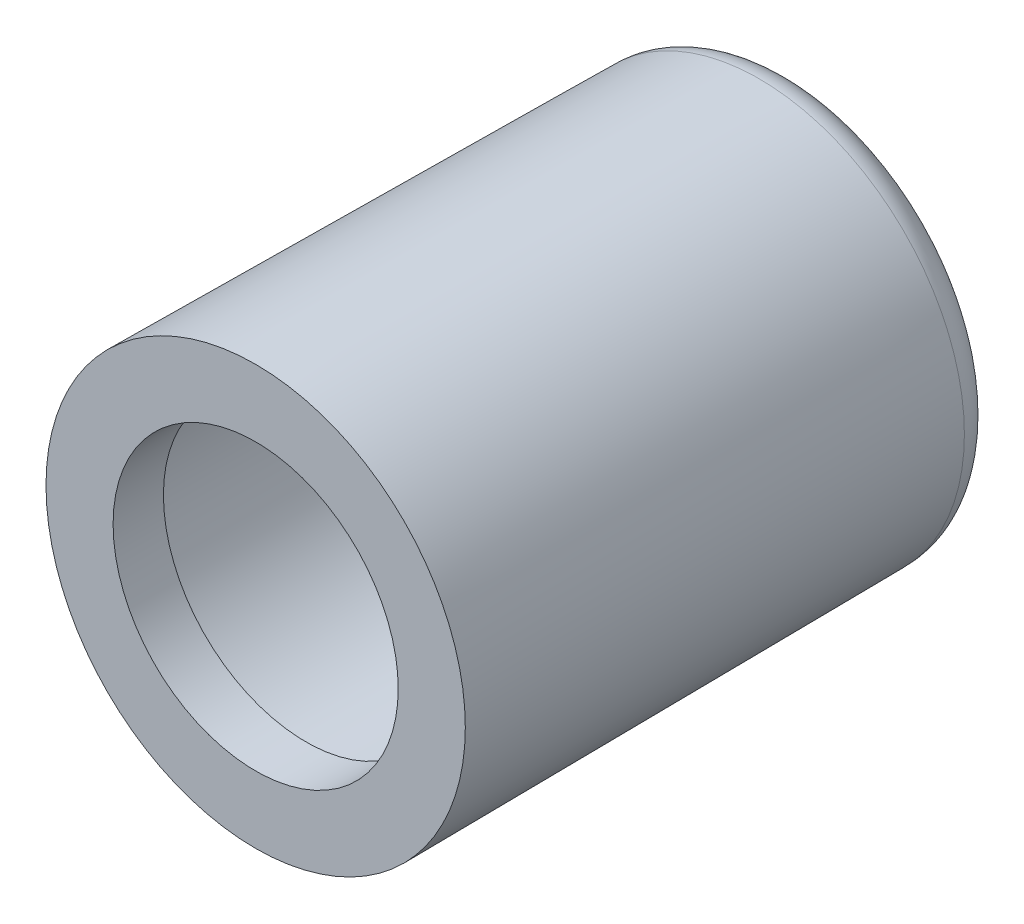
ISO-10303-21;
HEADER;
FILE_DESCRIPTION(('STEP AP214'),'2;1');
FILE_NAME('part.step','',(''),(''),'','','');
FILE_SCHEMA(('AUTOMOTIVE_DESIGN { 1 0 10303 214 1 1 1 1 }'));
ENDSEC;
DATA;
#1=APPLICATION_CONTEXT('core data for automotive mechanical design processes');
#2=APPLICATION_PROTOCOL_DEFINITION('international standard','automotive_design',2000,#1);
#3=PRODUCT_CONTEXT('',#1,'mechanical');
#4=PRODUCT('Part','Part','',(#3));
#5=PRODUCT_RELATED_PRODUCT_CATEGORY('part','',(#4));
#6=PRODUCT_DEFINITION_FORMATION('','',#4);
#7=PRODUCT_DEFINITION_CONTEXT('part definition',#1,'design');
#8=PRODUCT_DEFINITION('design','',#6,#7);
#9=PRODUCT_DEFINITION_SHAPE('','',#8);
#10=(LENGTH_UNIT() NAMED_UNIT(*) SI_UNIT(.MILLI.,.METRE.));
#11=(NAMED_UNIT(*) PLANE_ANGLE_UNIT() SI_UNIT($,.RADIAN.));
#12=(NAMED_UNIT(*) SI_UNIT($,.STERADIAN.) SOLID_ANGLE_UNIT());
#13=UNCERTAINTY_MEASURE_WITH_UNIT(LENGTH_MEASURE(1.E-05),#10,'distance_accuracy_value','');
#14=(GEOMETRIC_REPRESENTATION_CONTEXT(3) GLOBAL_UNCERTAINTY_ASSIGNED_CONTEXT((#13)) GLOBAL_UNIT_ASSIGNED_CONTEXT((#10,
#11,#12)) REPRESENTATION_CONTEXT('',''));
#15=CARTESIAN_POINT('',(0.,0.,0.));
#16=DIRECTION('',(0.,0.,1.));
#17=DIRECTION('',(1.,0.,0.));
#18=AXIS2_PLACEMENT_3D('',#15,#16,#17);
#19=CARTESIAN_POINT('',(0.,0.,0.));
#20=DIRECTION('',(0.,0.,1.));
#21=DIRECTION('',(1.,0.,0.));
#22=AXIS2_PLACEMENT_3D('',#19,#20,#21);
#23=CONICAL_SURFACE('',#22,12.5,0.00872664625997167);
#24=CARTESIAN_POINT('',(0.,0.,-30.0174530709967));
#25=DIRECTION('',(0.,0.,1.));
#26=DIRECTION('',(1.,0.,0.));
#27=AXIS2_PLACEMENT_3D('',#24,#25,#26);
#28=CIRCLE('',#27,12.2380416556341);
#29=CARTESIAN_POINT('',(12.2380416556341,0.,-30.0174530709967));
#30=VERTEX_POINT('',#29);
#31=EDGE_CURVE('E367',#30,#30,#28,.T.);
#32=ORIENTED_EDGE('',*,*,#31,.T.);
#33=EDGE_LOOP('',(#32));
#34=FACE_BOUND('',#33,.T.);
#35=CARTESIAN_POINT('',(0.,0.,0.));
#36=DIRECTION('',(0.,0.,1.));
#37=DIRECTION('',(1.,0.,0.));
#38=AXIS2_PLACEMENT_3D('',#35,#36,#37);
#39=CIRCLE('',#38,12.5);
#40=CARTESIAN_POINT('',(12.5,0.,0.));
#41=VERTEX_POINT('',#40);
#42=EDGE_CURVE('E371',#41,#41,#39,.T.);
#43=ORIENTED_EDGE('',*,*,#42,.F.);
#44=EDGE_LOOP('',(#43));
#45=FACE_BOUND('',#44,.T.);
#46=ADVANCED_FACE('F361',(#34,#45),#23,.T.);
#47=CARTESIAN_POINT('',(0.,0.,-32.));
#48=DIRECTION('',(0.,0.,1.));
#49=DIRECTION('',(1.,0.,0.));
#50=AXIS2_PLACEMENT_3D('',#47,#48,#49);
#51=PLANE('',#50);
#52=CARTESIAN_POINT('',(0.,0.,-32.));
#53=DIRECTION('',(0.,0.,1.));
#54=DIRECTION('',(1.,0.,0.));
#55=AXIS2_PLACEMENT_3D('',#52,#53,#54);
#56=CIRCLE('',#55,10.2381178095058);
#57=CARTESIAN_POINT('',(10.2381178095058,0.,-32.));
#58=VERTEX_POINT('',#57);
#59=EDGE_CURVE('E10',#58,#58,#56,.F.);
#60=ORIENTED_EDGE('',*,*,#59,.T.);
#61=EDGE_LOOP('',(#60));
#62=FACE_BOUND('',#61,.T.);
#63=CARTESIAN_POINT('',(0.,0.,-32.));
#64=DIRECTION('',(0.,0.,-1.));
#65=DIRECTION('',(-1.,0.,0.));
#66=AXIS2_PLACEMENT_3D('',#63,#64,#65);
#67=CIRCLE('',#66,10.);
#68=CARTESIAN_POINT('',(-10.,0.,-32.));
#69=VERTEX_POINT('',#68);
#70=EDGE_CURVE('E380',#69,#69,#67,.T.);
#71=ORIENTED_EDGE('',*,*,#70,.F.);
#72=EDGE_LOOP('',(#71));
#73=FACE_BOUND('',#72,.T.);
#74=ADVANCED_FACE('F405',(#62,#73),#51,.F.);
#75=CARTESIAN_POINT('',(0.,0.,0.));
#76=DIRECTION('',(0.,0.,1.));
#77=DIRECTION('',(1.,0.,0.));
#78=AXIS2_PLACEMENT_3D('',#75,#76,#77);
#79=PLANE('',#78);
#80=CARTESIAN_POINT('',(0.,0.,0.));
#81=DIRECTION('',(0.,0.,-1.));
#82=DIRECTION('',(-1.,0.,0.));
#83=AXIS2_PLACEMENT_3D('',#80,#81,#82);
#84=CIRCLE('',#83,8.5);
#85=CARTESIAN_POINT('',(-8.5,0.,0.));
#86=VERTEX_POINT('',#85);
#87=EDGE_CURVE('E383',#86,#86,#84,.T.);
#88=ORIENTED_EDGE('',*,*,#87,.T.);
#89=EDGE_LOOP('',(#88));
#90=FACE_BOUND('',#89,.T.);
#91=ORIENTED_EDGE('',*,*,#42,.T.);
#92=EDGE_LOOP('',(#91));
#93=FACE_BOUND('',#92,.T.);
#94=ADVANCED_FACE('F401',(#90,#93),#79,.T.);
#95=CARTESIAN_POINT('',(0.,0.,-3.));
#96=DIRECTION('',(0.,0.,-1.));
#97=DIRECTION('',(-1.,0.,0.));
#98=AXIS2_PLACEMENT_3D('',#95,#96,#97);
#99=CYLINDRICAL_SURFACE('',#98,10.);
#100=CARTESIAN_POINT('',(0.,0.,-3.));
#101=DIRECTION('',(0.,0.,-1.));
#102=DIRECTION('',(-1.,0.,0.));
#103=AXIS2_PLACEMENT_3D('',#100,#101,#102);
#104=CIRCLE('',#103,10.);
#105=CARTESIAN_POINT('',(-10.,0.,-3.));
#106=VERTEX_POINT('',#105);
#107=EDGE_CURVE('E375',#106,#106,#104,.T.);
#108=CARTESIAN_POINT('',(-10.,0.,-3.));
#109=CARTESIAN_POINT('',(-10.,0.,-3.30208333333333));
#110=CARTESIAN_POINT('',(-10.,0.,-3.60416666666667));
#111=CARTESIAN_POINT('',(-10.,0.,-4.20833333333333));
#112=CARTESIAN_POINT('',(-10.,0.,-4.51041666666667));
#113=CARTESIAN_POINT('',(-10.,0.,-5.11458333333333));
#114=CARTESIAN_POINT('',(-10.,0.,-5.41666666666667));
#115=CARTESIAN_POINT('',(-10.,0.,-6.02083333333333));
#116=CARTESIAN_POINT('',(-10.,0.,-6.32291666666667));
#117=CARTESIAN_POINT('',(-10.,0.,-6.92708333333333));
#118=CARTESIAN_POINT('',(-10.,0.,-7.22916666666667));
#119=CARTESIAN_POINT('',(-10.,0.,-7.83333333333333));
#120=CARTESIAN_POINT('',(-10.,0.,-8.13541666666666));
#121=CARTESIAN_POINT('',(-10.,0.,-8.73958333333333));
#122=CARTESIAN_POINT('',(-10.,0.,-9.04166666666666));
#123=CARTESIAN_POINT('',(-10.,0.,-9.64583333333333));
#124=CARTESIAN_POINT('',(-10.,0.,-9.94791666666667));
#125=CARTESIAN_POINT('',(-10.,0.,-10.5520833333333));
#126=CARTESIAN_POINT('',(-10.,0.,-10.8541666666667));
#127=CARTESIAN_POINT('',(-10.,0.,-11.4583333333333));
#128=CARTESIAN_POINT('',(-10.,0.,-11.7604166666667));
#129=CARTESIAN_POINT('',(-10.,0.,-12.3645833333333));
#130=CARTESIAN_POINT('',(-10.,0.,-12.6666666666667));
#131=CARTESIAN_POINT('',(-10.,0.,-13.2708333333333));
#132=CARTESIAN_POINT('',(-10.,0.,-13.5729166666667));
#133=CARTESIAN_POINT('',(-10.,0.,-14.1770833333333));
#134=CARTESIAN_POINT('',(-10.,0.,-14.4791666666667));
#135=CARTESIAN_POINT('',(-10.,0.,-15.0833333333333));
#136=CARTESIAN_POINT('',(-10.,0.,-15.3854166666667));
#137=CARTESIAN_POINT('',(-10.,0.,-15.9895833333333));
#138=CARTESIAN_POINT('',(-10.,0.,-16.2916666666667));
#139=CARTESIAN_POINT('',(-10.,0.,-16.8958333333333));
#140=CARTESIAN_POINT('',(-10.,0.,-17.1979166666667));
#141=CARTESIAN_POINT('',(-10.,0.,-17.8020833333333));
#142=CARTESIAN_POINT('',(-10.,0.,-18.1041666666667));
#143=CARTESIAN_POINT('',(-10.,0.,-18.7083333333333));
#144=CARTESIAN_POINT('',(-10.,0.,-19.0104166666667));
#145=CARTESIAN_POINT('',(-10.,0.,-19.6145833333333));
#146=CARTESIAN_POINT('',(-10.,0.,-19.9166666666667));
#147=CARTESIAN_POINT('',(-10.,0.,-20.5208333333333));
#148=CARTESIAN_POINT('',(-10.,0.,-20.8229166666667));
#149=CARTESIAN_POINT('',(-10.,0.,-21.4270833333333));
#150=CARTESIAN_POINT('',(-10.,0.,-21.7291666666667));
#151=CARTESIAN_POINT('',(-10.,0.,-22.3333333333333));
#152=CARTESIAN_POINT('',(-10.,0.,-22.6354166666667));
#153=CARTESIAN_POINT('',(-10.,0.,-23.2395833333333));
#154=CARTESIAN_POINT('',(-10.,0.,-23.5416666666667));
#155=CARTESIAN_POINT('',(-10.,0.,-24.1458333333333));
#156=CARTESIAN_POINT('',(-10.,0.,-24.4479166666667));
#157=CARTESIAN_POINT('',(-10.,0.,-25.0520833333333));
#158=CARTESIAN_POINT('',(-10.,0.,-25.3541666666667));
#159=CARTESIAN_POINT('',(-10.,0.,-25.9583333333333));
#160=CARTESIAN_POINT('',(-10.,0.,-26.2604166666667));
#161=CARTESIAN_POINT('',(-10.,0.,-26.8645833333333));
#162=CARTESIAN_POINT('',(-10.,0.,-27.1666666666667));
#163=CARTESIAN_POINT('',(-10.,0.,-27.7708333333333));
#164=CARTESIAN_POINT('',(-10.,0.,-28.0729166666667));
#165=CARTESIAN_POINT('',(-10.,0.,-28.6770833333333));
#166=CARTESIAN_POINT('',(-10.,0.,-28.9791666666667));
#167=CARTESIAN_POINT('',(-10.,0.,-29.5833333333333));
#168=CARTESIAN_POINT('',(-10.,0.,-29.8854166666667));
#169=CARTESIAN_POINT('',(-10.,0.,-30.4895833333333));
#170=CARTESIAN_POINT('',(-10.,0.,-30.7916666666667));
#171=CARTESIAN_POINT('',(-10.,0.,-31.3958333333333));
#172=CARTESIAN_POINT('',(-10.,0.,-31.6979166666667));
#173=CARTESIAN_POINT('',(-10.,0.,-32.));
#174=B_SPLINE_CURVE_WITH_KNOTS('',3,(#108,#109,#110,#111,#112,#113,#114,#115,#116,#117,#118,
#119,#120,#121,#122,#123,#124,#125,#126,#127,#128,#129,#130,#131,#132,#133,#134,#135,#136,#137,
#138,#139,#140,#141,#142,#143,#144,#145,#146,#147,#148,#149,#150,#151,#152,#153,#154,#155,#156,
#157,#158,#159,#160,#161,#162,#163,#164,#165,#166,#167,#168,#169,#170,#171,#172,#173),
.UNSPECIFIED.,.F.,.F.,(4,2,2,2,2,2,2,2,2,2,2,2,2,2,2,2,2,2,2,2,2,2,2,2,2,2,2,2,2,2,2,2,4),(0.,
0.90625,1.8125,2.71875,3.625,4.53125,5.4375,6.34375,7.25,8.15625,9.0625,9.96875,10.875,11.78125,
12.6875,13.59375,14.5,15.40625,16.3125,17.21875,18.125,19.03125,19.9375,20.84375,21.75,22.65625,
23.5625,24.46875,25.375,26.28125,27.1875,28.09375,29.),.UNSPECIFIED.);
#175=EDGE_CURVE('BSEAM395',#106,#69,#174,.T.);
#176=ORIENTED_EDGE('',*,*,#107,.F.);
#177=ORIENTED_EDGE('',*,*,#70,.T.);
#178=ORIENTED_EDGE('',*,*,#175,.T.);
#179=ORIENTED_EDGE('',*,*,#175,.F.);
#180=EDGE_LOOP('',(#176,#178,#177,#179));
#181=FACE_BOUND('',#180,.T.);
#182=ADVANCED_FACE('F395',(#181),#99,.F.);
#183=CARTESIAN_POINT('',(0.,0.,-3.));
#184=DIRECTION('',(0.,0.,-1.));
#185=DIRECTION('',(-1.,0.,0.));
#186=AXIS2_PLACEMENT_3D('',#183,#184,#185);
#187=PLANE('',#186);
#188=CARTESIAN_POINT('',(0.,0.,-3.));
#189=DIRECTION('',(0.,0.,-1.));
#190=DIRECTION('',(-1.,0.,0.));
#191=AXIS2_PLACEMENT_3D('',#188,#189,#190);
#192=CIRCLE('',#191,8.5);
#193=CARTESIAN_POINT('',(-8.5,0.,-3.));
#194=VERTEX_POINT('',#193);
#195=EDGE_CURVE('E386',#194,#194,#192,.T.);
#196=ORIENTED_EDGE('',*,*,#195,.F.);
#197=EDGE_LOOP('',(#196));
#198=FACE_BOUND('',#197,.T.);
#199=ORIENTED_EDGE('',*,*,#107,.T.);
#200=EDGE_LOOP('',(#199));
#201=FACE_BOUND('',#200,.T.);
#202=ADVANCED_FACE('F392',(#198,#201),#187,.T.);
#203=CARTESIAN_POINT('',(0.,0.,0.));
#204=DIRECTION('',(0.,0.,-1.));
#205=DIRECTION('',(-1.,0.,0.));
#206=AXIS2_PLACEMENT_3D('',#203,#204,#205);
#207=CYLINDRICAL_SURFACE('',#206,8.5);
#208=ORIENTED_EDGE('',*,*,#87,.F.);
#209=EDGE_LOOP('',(#208));
#210=FACE_BOUND('',#209,.T.);
#211=ORIENTED_EDGE('',*,*,#195,.T.);
#212=EDGE_LOOP('',(#211));
#213=FACE_BOUND('',#212,.T.);
#214=ADVANCED_FACE('F390',(#210,#213),#207,.F.);
#215=CARTESIAN_POINT('',(0.,0.,-30.));
#216=DIRECTION('',(0.,0.,1.));
#217=DIRECTION('',(1.,0.,0.));
#218=AXIS2_PLACEMENT_3D('',#215,#216,#217);
#219=TOROIDAL_SURFACE('',#218,10.2381178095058,2.);
#220=ORIENTED_EDGE('',*,*,#59,.F.);
#221=EDGE_LOOP('',(#220));
#222=FACE_BOUND('',#221,.T.);
#223=ORIENTED_EDGE('',*,*,#31,.F.);
#224=EDGE_LOOP('',(#223));
#225=FACE_BOUND('',#224,.T.);
#226=ADVANCED_FACE('F416',(#222,#225),#219,.T.);
#227=CLOSED_SHELL('',(#46,#74,#94,#182,#202,#214,#226));
#228=MANIFOLD_SOLID_BREP('B2',#227);
#229=ADVANCED_BREP_SHAPE_REPRESENTATION('',(#18,#228),#14);
#230=SHAPE_DEFINITION_REPRESENTATION(#9,#229);
ENDSEC;
END-ISO-10303-21;
